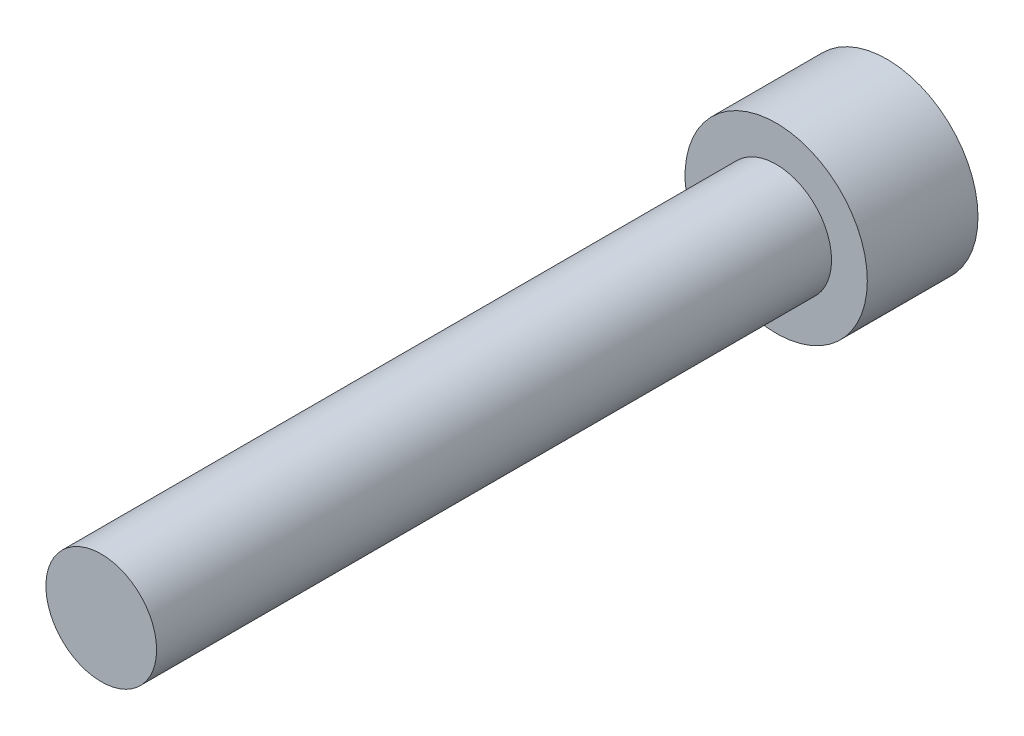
ISO-10303-21;
HEADER;
FILE_DESCRIPTION(('STEP AP214'),'2;1');
FILE_NAME('part.step','',(''),(''),'','','');
FILE_SCHEMA(('AUTOMOTIVE_DESIGN { 1 0 10303 214 1 1 1 1 }'));
ENDSEC;
DATA;
#1=APPLICATION_CONTEXT('core data for automotive mechanical design processes');
#2=APPLICATION_PROTOCOL_DEFINITION('international standard','automotive_design',2000,#1);
#3=PRODUCT_CONTEXT('',#1,'mechanical');
#4=PRODUCT('Part','Part','',(#3));
#5=PRODUCT_RELATED_PRODUCT_CATEGORY('part','',(#4));
#6=PRODUCT_DEFINITION_FORMATION('','',#4);
#7=PRODUCT_DEFINITION_CONTEXT('part definition',#1,'design');
#8=PRODUCT_DEFINITION('design','',#6,#7);
#9=PRODUCT_DEFINITION_SHAPE('','',#8);
#10=(LENGTH_UNIT() NAMED_UNIT(*) SI_UNIT(.MILLI.,.METRE.));
#11=(NAMED_UNIT(*) PLANE_ANGLE_UNIT() SI_UNIT($,.RADIAN.));
#12=(NAMED_UNIT(*) SI_UNIT($,.STERADIAN.) SOLID_ANGLE_UNIT());
#13=UNCERTAINTY_MEASURE_WITH_UNIT(LENGTH_MEASURE(1.E-05),#10,'distance_accuracy_value','');
#14=(GEOMETRIC_REPRESENTATION_CONTEXT(3) GLOBAL_UNCERTAINTY_ASSIGNED_CONTEXT((#13)) GLOBAL_UNIT_ASSIGNED_CONTEXT((#10,
#11,#12)) REPRESENTATION_CONTEXT('',''));
#15=CARTESIAN_POINT('',(0.,0.,0.));
#16=DIRECTION('',(0.,0.,1.));
#17=DIRECTION('',(1.,0.,0.));
#18=AXIS2_PLACEMENT_3D('',#15,#16,#17);
#19=CARTESIAN_POINT('',(0.,0.,25.4));
#20=DIRECTION('',(0.,0.,1.));
#21=DIRECTION('',(1.,0.,0.));
#22=AXIS2_PLACEMENT_3D('',#19,#20,#21);
#23=PLANE('',#22);
#24=CARTESIAN_POINT('',(0.,0.,25.4));
#25=DIRECTION('',(0.,0.,1.));
#26=DIRECTION('',(1.,0.,0.));
#27=AXIS2_PLACEMENT_3D('',#24,#25,#26);
#28=CIRCLE('',#27,2.0828);
#29=CARTESIAN_POINT('',(2.0828,0.,25.4));
#30=VERTEX_POINT('',#29);
#31=EDGE_CURVE('E11',#30,#30,#28,.T.);
#32=ORIENTED_EDGE('',*,*,#31,.T.);
#33=EDGE_LOOP('',(#32));
#34=FACE_BOUND('',#33,.T.);
#35=ADVANCED_FACE('F33',(#34),#23,.T.);
#36=CARTESIAN_POINT('',(0.,0.,25.4));
#37=DIRECTION('',(0.,0.,1.));
#38=DIRECTION('',(1.,0.,0.));
#39=AXIS2_PLACEMENT_3D('',#36,#37,#38);
#40=CYLINDRICAL_SURFACE('',#39,2.0828);
#41=CARTESIAN_POINT('',(0.,0.,0.));
#42=DIRECTION('',(0.,0.,1.));
#43=DIRECTION('',(1.,0.,0.));
#44=AXIS2_PLACEMENT_3D('',#41,#42,#43);
#45=CIRCLE('',#44,2.0828);
#46=CARTESIAN_POINT('',(2.0828,0.,0.));
#47=VERTEX_POINT('',#46);
#48=EDGE_CURVE('E40',#47,#47,#45,.T.);
#49=ORIENTED_EDGE('',*,*,#48,.T.);
#50=EDGE_LOOP('',(#49));
#51=FACE_BOUND('',#50,.T.);
#52=ORIENTED_EDGE('',*,*,#31,.F.);
#53=EDGE_LOOP('',(#52));
#54=FACE_BOUND('',#53,.T.);
#55=ADVANCED_FACE('F147',(#51,#54),#40,.T.);
#56=CARTESIAN_POINT('',(0.,-2.0828,0.));
#57=DIRECTION('',(0.,0.,1.));
#58=DIRECTION('',(1.,0.,0.));
#59=AXIS2_PLACEMENT_3D('',#56,#57,#58);
#60=PLANE('',#59);
#61=CARTESIAN_POINT('',(0.,0.,0.));
#62=DIRECTION('',(0.,0.,1.));
#63=DIRECTION('',(1.,0.,0.));
#64=AXIS2_PLACEMENT_3D('',#61,#62,#63);
#65=CIRCLE('',#64,3.429);
#66=CARTESIAN_POINT('',(3.429,0.,0.));
#67=VERTEX_POINT('',#66);
#68=EDGE_CURVE('E142',#67,#67,#65,.T.);
#69=ORIENTED_EDGE('',*,*,#68,.T.);
#70=EDGE_LOOP('',(#69));
#71=FACE_BOUND('',#70,.T.);
#72=ORIENTED_EDGE('',*,*,#48,.F.);
#73=EDGE_LOOP('',(#72));
#74=FACE_BOUND('',#73,.T.);
#75=ADVANCED_FACE('F150',(#71,#74),#60,.T.);
#76=CARTESIAN_POINT('',(0.,0.,25.4));
#77=DIRECTION('',(0.,0.,1.));
#78=DIRECTION('',(1.,0.,0.));
#79=AXIS2_PLACEMENT_3D('',#76,#77,#78);
#80=CYLINDRICAL_SURFACE('',#79,3.429);
#81=CARTESIAN_POINT('',(0.,0.,-4.1656));
#82=DIRECTION('',(0.,0.,1.));
#83=DIRECTION('',(1.,0.,0.));
#84=AXIS2_PLACEMENT_3D('',#81,#82,#83);
#85=CIRCLE('',#84,3.429);
#86=CARTESIAN_POINT('',(3.429,0.,-4.1656));
#87=VERTEX_POINT('',#86);
#88=EDGE_CURVE('E134',#87,#87,#85,.T.);
#89=ORIENTED_EDGE('',*,*,#88,.T.);
#90=EDGE_LOOP('',(#89));
#91=FACE_BOUND('',#90,.T.);
#92=ORIENTED_EDGE('',*,*,#68,.F.);
#93=EDGE_LOOP('',(#92));
#94=FACE_BOUND('',#93,.T.);
#95=ADVANCED_FACE('F152',(#91,#94),#80,.T.);
#96=CARTESIAN_POINT('',(0.,-3.429,-4.1656));
#97=DIRECTION('',(0.,0.,-1.));
#98=DIRECTION('',(-1.,0.,0.));
#99=AXIS2_PLACEMENT_3D('',#96,#97,#98);
#100=PLANE('',#99);
#101=DIRECTION('',(0.866025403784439,-0.5,0.));
#102=VECTOR('',#101,1.);
#103=CARTESIAN_POINT('',(0.,2.05305755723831,-4.1656));
#104=LINE('',#103,#102);
#105=CARTESIAN_POINT('',(0.,2.05305755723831,-4.1656));
#106=VERTEX_POINT('',#105);
#107=CARTESIAN_POINT('',(1.778,1.02652877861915,-4.1656));
#108=VERTEX_POINT('',#107);
#109=EDGE_CURVE('E47',#106,#108,#104,.T.);
#110=ORIENTED_EDGE('',*,*,#109,.F.);
#111=DIRECTION('',(0.866025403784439,0.5,0.));
#112=VECTOR('',#111,1.);
#113=CARTESIAN_POINT('',(-1.778,1.02652877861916,-4.1656));
#114=LINE('',#113,#112);
#115=CARTESIAN_POINT('',(-1.778,1.02652877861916,-4.1656));
#116=VERTEX_POINT('',#115);
#117=EDGE_CURVE('E130',#116,#106,#114,.T.);
#118=ORIENTED_EDGE('',*,*,#117,.F.);
#119=DIRECTION('',(0.,1.,0.));
#120=VECTOR('',#119,1.);
#121=CARTESIAN_POINT('',(-1.778,-1.02652877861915,-4.1656));
#122=LINE('',#121,#120);
#123=CARTESIAN_POINT('',(-1.778,-1.02652877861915,-4.1656));
#124=VERTEX_POINT('',#123);
#125=EDGE_CURVE('E128',#124,#116,#122,.T.);
#126=ORIENTED_EDGE('',*,*,#125,.F.);
#127=DIRECTION('',(-0.866025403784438,0.5,0.));
#128=VECTOR('',#127,1.);
#129=CARTESIAN_POINT('',(0.,-2.05305755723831,-4.1656));
#130=LINE('',#129,#128);
#131=CARTESIAN_POINT('',(0.,-2.05305755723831,-4.1656));
#132=VERTEX_POINT('',#131);
#133=EDGE_CURVE('E95',#132,#124,#130,.T.);
#134=ORIENTED_EDGE('',*,*,#133,.F.);
#135=DIRECTION('',(-0.866025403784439,-0.5,0.));
#136=VECTOR('',#135,1.);
#137=CARTESIAN_POINT('',(1.778,-1.02652877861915,-4.1656));
#138=LINE('',#137,#136);
#139=CARTESIAN_POINT('',(1.778,-1.02652877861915,-4.1656));
#140=VERTEX_POINT('',#139);
#141=EDGE_CURVE('E124',#140,#132,#138,.T.);
#142=ORIENTED_EDGE('',*,*,#141,.F.);
#143=DIRECTION('',(0.,-1.,0.));
#144=VECTOR('',#143,1.);
#145=CARTESIAN_POINT('',(1.778,1.02652877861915,-4.1656));
#146=LINE('',#145,#144);
#147=EDGE_CURVE('E121',#108,#140,#146,.T.);
#148=ORIENTED_EDGE('',*,*,#147,.F.);
#149=EDGE_LOOP('',(#110,#118,#126,#134,#142,#148));
#150=FACE_BOUND('',#149,.T.);
#151=ORIENTED_EDGE('',*,*,#88,.F.);
#152=EDGE_LOOP('',(#151));
#153=FACE_BOUND('',#152,.T.);
#154=ADVANCED_FACE('F159',(#150,#153),#100,.T.);
#155=CARTESIAN_POINT('',(0.,2.05305755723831,-1.3716));
#156=DIRECTION('',(0.5,0.866025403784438,0.));
#157=DIRECTION('',(-0.866025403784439,0.5,0.));
#158=AXIS2_PLACEMENT_3D('',#155,#156,#157);
#159=PLANE('',#158);
#160=ORIENTED_EDGE('',*,*,#109,.T.);
#161=DIRECTION('',(0.,0.,-1.));
#162=VECTOR('',#161,1.);
#163=CARTESIAN_POINT('',(1.778,1.02652877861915,-1.3716));
#164=LINE('',#163,#162);
#165=CARTESIAN_POINT('',(1.778,1.02652877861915,-1.3716));
#166=VERTEX_POINT('',#165);
#167=EDGE_CURVE('E77',#166,#108,#164,.T.);
#168=ORIENTED_EDGE('',*,*,#167,.F.);
#169=DIRECTION('',(0.866025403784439,-0.5,0.));
#170=VECTOR('',#169,1.);
#171=CARTESIAN_POINT('',(0.,2.05305755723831,-1.3716));
#172=LINE('',#171,#170);
#173=CARTESIAN_POINT('',(0.,2.05305755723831,-1.3716));
#174=VERTEX_POINT('',#173);
#175=EDGE_CURVE('E132',#174,#166,#172,.T.);
#176=ORIENTED_EDGE('',*,*,#175,.F.);
#177=DIRECTION('',(0.,0.,-1.));
#178=VECTOR('',#177,1.);
#179=CARTESIAN_POINT('',(0.,2.05305755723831,-1.3716));
#180=LINE('',#179,#178);
#181=EDGE_CURVE('E55',#174,#106,#180,.T.);
#182=ORIENTED_EDGE('',*,*,#181,.T.);
#183=EDGE_LOOP('',(#160,#168,#176,#182));
#184=FACE_BOUND('',#183,.T.);
#185=ADVANCED_FACE('F190',(#184),#159,.F.);
#186=CARTESIAN_POINT('',(-1.778,1.02652877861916,-1.3716));
#187=DIRECTION('',(-0.5,0.866025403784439,0.));
#188=DIRECTION('',(-0.866025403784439,-0.5,0.));
#189=AXIS2_PLACEMENT_3D('',#186,#187,#188);
#190=PLANE('',#189);
#191=ORIENTED_EDGE('',*,*,#117,.T.);
#192=ORIENTED_EDGE('',*,*,#181,.F.);
#193=DIRECTION('',(0.866025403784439,0.5,0.));
#194=VECTOR('',#193,1.);
#195=CARTESIAN_POINT('',(-1.778,1.02652877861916,-1.3716));
#196=LINE('',#195,#194);
#197=CARTESIAN_POINT('',(-1.778,1.02652877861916,-1.3716));
#198=VERTEX_POINT('',#197);
#199=EDGE_CURVE('E107',#198,#174,#196,.T.);
#200=ORIENTED_EDGE('',*,*,#199,.F.);
#201=DIRECTION('',(0.,0.,-1.));
#202=VECTOR('',#201,1.);
#203=CARTESIAN_POINT('',(-1.778,1.02652877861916,-1.3716));
#204=LINE('',#203,#202);
#205=EDGE_CURVE('E99',#198,#116,#204,.T.);
#206=ORIENTED_EDGE('',*,*,#205,.T.);
#207=EDGE_LOOP('',(#191,#192,#200,#206));
#208=FACE_BOUND('',#207,.T.);
#209=ADVANCED_FACE('F200',(#208),#190,.F.);
#210=CARTESIAN_POINT('',(-1.778,-1.02652877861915,-1.3716));
#211=DIRECTION('',(-1.,0.,0.));
#212=DIRECTION('',(0.,0.,1.));
#213=AXIS2_PLACEMENT_3D('',#210,#211,#212);
#214=PLANE('',#213);
#215=ORIENTED_EDGE('',*,*,#125,.T.);
#216=ORIENTED_EDGE('',*,*,#205,.F.);
#217=DIRECTION('',(0.,1.,0.));
#218=VECTOR('',#217,1.);
#219=CARTESIAN_POINT('',(-1.778,-1.02652877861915,-1.3716));
#220=LINE('',#219,#218);
#221=CARTESIAN_POINT('',(-1.778,-1.02652877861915,-1.3716));
#222=VERTEX_POINT('',#221);
#223=EDGE_CURVE('E103',#222,#198,#220,.T.);
#224=ORIENTED_EDGE('',*,*,#223,.F.);
#225=DIRECTION('',(0.,0.,-1.));
#226=VECTOR('',#225,1.);
#227=CARTESIAN_POINT('',(-1.778,-1.02652877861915,-1.3716));
#228=LINE('',#227,#226);
#229=EDGE_CURVE('E88',#222,#124,#228,.T.);
#230=ORIENTED_EDGE('',*,*,#229,.T.);
#231=EDGE_LOOP('',(#215,#216,#224,#230));
#232=FACE_BOUND('',#231,.T.);
#233=ADVANCED_FACE('F104',(#232),#214,.F.);
#234=CARTESIAN_POINT('',(0.,-2.05305755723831,-1.3716));
#235=DIRECTION('',(-0.5,-0.866025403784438,0.));
#236=DIRECTION('',(0.866025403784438,-0.5,0.));
#237=AXIS2_PLACEMENT_3D('',#234,#235,#236);
#238=PLANE('',#237);
#239=ORIENTED_EDGE('',*,*,#133,.T.);
#240=ORIENTED_EDGE('',*,*,#229,.F.);
#241=DIRECTION('',(-0.866025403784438,0.5,0.));
#242=VECTOR('',#241,1.);
#243=CARTESIAN_POINT('',(0.,-2.05305755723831,-1.3716));
#244=LINE('',#243,#242);
#245=CARTESIAN_POINT('',(0.,-2.05305755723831,-1.3716));
#246=VERTEX_POINT('',#245);
#247=EDGE_CURVE('E92',#246,#222,#244,.T.);
#248=ORIENTED_EDGE('',*,*,#247,.F.);
#249=DIRECTION('',(0.,0.,-1.));
#250=VECTOR('',#249,1.);
#251=CARTESIAN_POINT('',(0.,-2.05305755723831,-1.3716));
#252=LINE('',#251,#250);
#253=EDGE_CURVE('E100',#246,#132,#252,.T.);
#254=ORIENTED_EDGE('',*,*,#253,.T.);
#255=EDGE_LOOP('',(#239,#240,#248,#254));
#256=FACE_BOUND('',#255,.T.);
#257=ADVANCED_FACE('F90',(#256),#238,.F.);
#258=CARTESIAN_POINT('',(1.778,-1.02652877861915,-1.3716));
#259=DIRECTION('',(0.5,-0.866025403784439,0.));
#260=DIRECTION('',(0.866025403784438,0.5,0.));
#261=AXIS2_PLACEMENT_3D('',#258,#259,#260);
#262=PLANE('',#261);
#263=ORIENTED_EDGE('',*,*,#141,.T.);
#264=ORIENTED_EDGE('',*,*,#253,.F.);
#265=DIRECTION('',(-0.866025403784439,-0.5,0.));
#266=VECTOR('',#265,1.);
#267=CARTESIAN_POINT('',(1.778,-1.02652877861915,-1.3716));
#268=LINE('',#267,#266);
#269=CARTESIAN_POINT('',(1.778,-1.02652877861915,-1.3716));
#270=VERTEX_POINT('',#269);
#271=EDGE_CURVE('E113',#270,#246,#268,.T.);
#272=ORIENTED_EDGE('',*,*,#271,.F.);
#273=DIRECTION('',(0.,0.,-1.));
#274=VECTOR('',#273,1.);
#275=CARTESIAN_POINT('',(1.778,-1.02652877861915,-1.3716));
#276=LINE('',#275,#274);
#277=EDGE_CURVE('E137',#270,#140,#276,.T.);
#278=ORIENTED_EDGE('',*,*,#277,.T.);
#279=EDGE_LOOP('',(#263,#264,#272,#278));
#280=FACE_BOUND('',#279,.T.);
#281=ADVANCED_FACE('F225',(#280),#262,.F.);
#282=CARTESIAN_POINT('',(1.778,1.02652877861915,-1.3716));
#283=DIRECTION('',(1.,0.,0.));
#284=DIRECTION('',(0.,0.,-1.));
#285=AXIS2_PLACEMENT_3D('',#282,#283,#284);
#286=PLANE('',#285);
#287=ORIENTED_EDGE('',*,*,#147,.T.);
#288=ORIENTED_EDGE('',*,*,#277,.F.);
#289=DIRECTION('',(0.,-1.,0.));
#290=VECTOR('',#289,1.);
#291=CARTESIAN_POINT('',(1.778,1.02652877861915,-1.3716));
#292=LINE('',#291,#290);
#293=EDGE_CURVE('E115',#166,#270,#292,.T.);
#294=ORIENTED_EDGE('',*,*,#293,.F.);
#295=ORIENTED_EDGE('',*,*,#167,.T.);
#296=EDGE_LOOP('',(#287,#288,#294,#295));
#297=FACE_BOUND('',#296,.T.);
#298=ADVANCED_FACE('F234',(#297),#286,.F.);
#299=CARTESIAN_POINT('',(3.556,0.,-1.3716));
#300=DIRECTION('',(0.,0.,-1.));
#301=DIRECTION('',(-1.,0.,0.));
#302=AXIS2_PLACEMENT_3D('',#299,#300,#301);
#303=PLANE('',#302);
#304=ORIENTED_EDGE('',*,*,#175,.T.);
#305=ORIENTED_EDGE('',*,*,#293,.T.);
#306=ORIENTED_EDGE('',*,*,#271,.T.);
#307=ORIENTED_EDGE('',*,*,#247,.T.);
#308=ORIENTED_EDGE('',*,*,#223,.T.);
#309=ORIENTED_EDGE('',*,*,#199,.T.);
#310=EDGE_LOOP('',(#304,#305,#306,#307,#308,#309));
#311=FACE_BOUND('',#310,.T.);
#312=ADVANCED_FACE('F110',(#311),#303,.T.);
#313=CLOSED_SHELL('',(#35,#55,#75,#95,#154,#185,#209,#233,#257,#281,#298,#312));
#314=MANIFOLD_SOLID_BREP('B2',#313);
#315=ADVANCED_BREP_SHAPE_REPRESENTATION('',(#18,#314),#14);
#316=SHAPE_DEFINITION_REPRESENTATION(#9,#315);
ENDSEC;
END-ISO-10303-21;
